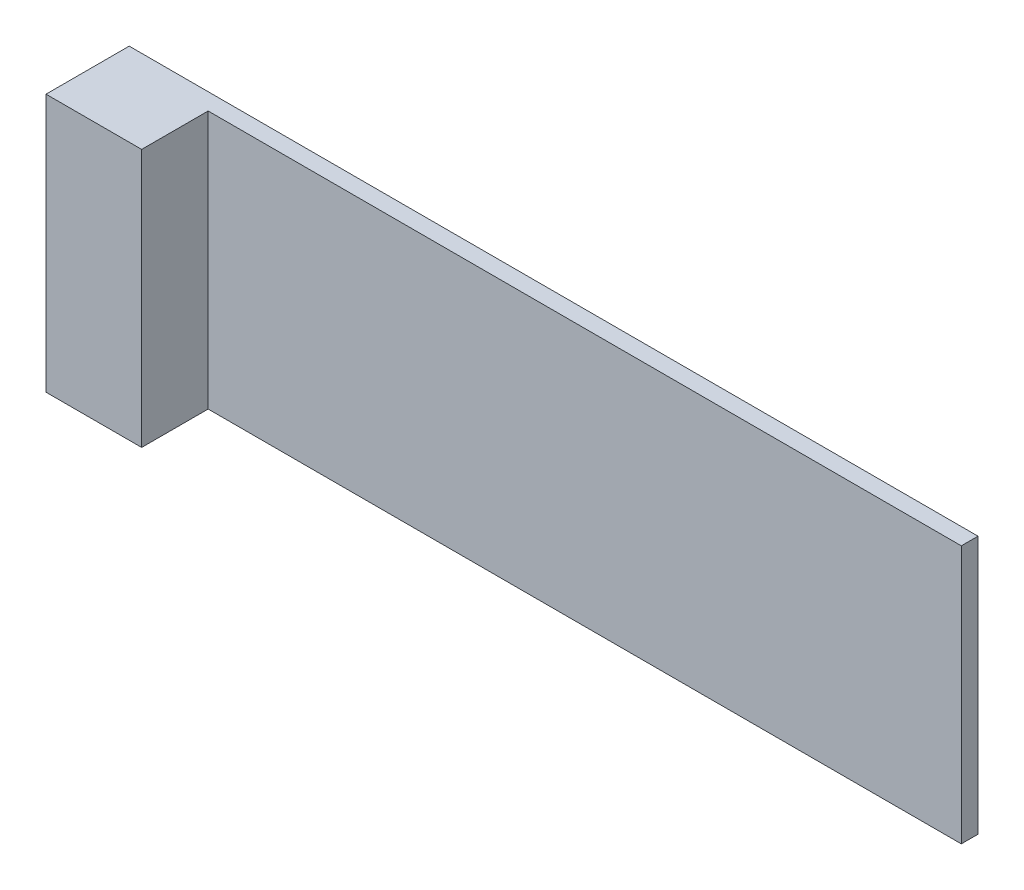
ISO-10303-21;
HEADER;
FILE_DESCRIPTION(('STEP AP214'),'2;1');
FILE_NAME('part.step','',(''),(''),'','','');
FILE_SCHEMA(('AUTOMOTIVE_DESIGN { 1 0 10303 214 1 1 1 1 }'));
ENDSEC;
DATA;
#1=APPLICATION_CONTEXT('core data for automotive mechanical design processes');
#2=APPLICATION_PROTOCOL_DEFINITION('international standard','automotive_design',2000,#1);
#3=PRODUCT_CONTEXT('',#1,'mechanical');
#4=PRODUCT('Part','Part','',(#3));
#5=PRODUCT_RELATED_PRODUCT_CATEGORY('part','',(#4));
#6=PRODUCT_DEFINITION_FORMATION('','',#4);
#7=PRODUCT_DEFINITION_CONTEXT('part definition',#1,'design');
#8=PRODUCT_DEFINITION('design','',#6,#7);
#9=PRODUCT_DEFINITION_SHAPE('','',#8);
#10=(LENGTH_UNIT() NAMED_UNIT(*) SI_UNIT(.MILLI.,.METRE.));
#11=(NAMED_UNIT(*) PLANE_ANGLE_UNIT() SI_UNIT($,.RADIAN.));
#12=(NAMED_UNIT(*) SI_UNIT($,.STERADIAN.) SOLID_ANGLE_UNIT());
#13=UNCERTAINTY_MEASURE_WITH_UNIT(LENGTH_MEASURE(1.E-05),#10,'distance_accuracy_value','');
#14=(GEOMETRIC_REPRESENTATION_CONTEXT(3) GLOBAL_UNCERTAINTY_ASSIGNED_CONTEXT((#13)) GLOBAL_UNIT_ASSIGNED_CONTEXT((#10,
#11,#12)) REPRESENTATION_CONTEXT('',''));
#15=CARTESIAN_POINT('',(0.,0.,0.));
#16=DIRECTION('',(0.,0.,1.));
#17=DIRECTION('',(1.,0.,0.));
#18=AXIS2_PLACEMENT_3D('',#15,#16,#17);
#19=CARTESIAN_POINT('',(-3.404,-0.394,0.051));
#20=DIRECTION('',(0.,0.,1.));
#21=DIRECTION('',(1.,0.,0.));
#22=AXIS2_PLACEMENT_3D('',#19,#20,#21);
#23=PLANE('',#22);
#24=DIRECTION('',(1.,0.,0.));
#25=VECTOR('',#24,1.);
#26=CARTESIAN_POINT('',(-1.105,0.394,0.051));
#27=LINE('',#26,#25);
#28=CARTESIAN_POINT('',(-3.404,0.394,0.051));
#29=VERTEX_POINT('',#28);
#30=CARTESIAN_POINT('',(-1.105,0.394,0.051));
#31=VERTEX_POINT('',#30);
#32=EDGE_CURVE('E83',#29,#31,#27,.T.);
#33=ORIENTED_EDGE('',*,*,#32,.F.);
#34=DIRECTION('',(0.,1.,0.));
#35=VECTOR('',#34,1.);
#36=CARTESIAN_POINT('',(-3.404,-0.394,0.051));
#37=LINE('',#36,#35);
#38=CARTESIAN_POINT('',(-3.404,-0.394,0.051));
#39=VERTEX_POINT('',#38);
#40=EDGE_CURVE('E20',#39,#29,#37,.T.);
#41=ORIENTED_EDGE('',*,*,#40,.F.);
#42=DIRECTION('',(1.,0.,0.));
#43=VECTOR('',#42,1.);
#44=CARTESIAN_POINT('',(-3.696,-0.394,0.051));
#45=LINE('',#44,#43);
#46=CARTESIAN_POINT('',(-1.105,-0.394,0.051));
#47=VERTEX_POINT('',#46);
#48=EDGE_CURVE('E100',#47,#39,#45,.F.);
#49=ORIENTED_EDGE('',*,*,#48,.F.);
#50=DIRECTION('',(0.,1.,0.));
#51=VECTOR('',#50,1.);
#52=CARTESIAN_POINT('',(-1.105,-0.394,0.051));
#53=LINE('',#52,#51);
#54=EDGE_CURVE('E95',#31,#47,#53,.F.);
#55=ORIENTED_EDGE('',*,*,#54,.F.);
#56=EDGE_LOOP('',(#33,#41,#49,#55));
#57=FACE_BOUND('',#56,.T.);
#58=ADVANCED_FACE('F17',(#57),#23,.T.);
#59=CARTESIAN_POINT('',(-3.404,-0.394,0.051));
#60=DIRECTION('',(1.,0.,0.));
#61=DIRECTION('',(0.,0.,-1.));
#62=AXIS2_PLACEMENT_3D('',#59,#60,#61);
#63=PLANE('',#62);
#64=DIRECTION('',(0.,1.,0.));
#65=VECTOR('',#64,1.);
#66=CARTESIAN_POINT('',(-3.404,-0.394,0.254));
#67=LINE('',#66,#65);
#68=CARTESIAN_POINT('',(-3.404,-0.394,0.254));
#69=VERTEX_POINT('',#68);
#70=CARTESIAN_POINT('',(-3.404,0.394,0.254));
#71=VERTEX_POINT('',#70);
#72=EDGE_CURVE('E71',#69,#71,#67,.T.);
#73=ORIENTED_EDGE('',*,*,#72,.F.);
#74=DIRECTION('',(0.,0.,-1.));
#75=VECTOR('',#74,1.);
#76=CARTESIAN_POINT('',(-3.404,-0.394,0.));
#77=LINE('',#76,#75);
#78=EDGE_CURVE('E103',#39,#69,#77,.F.);
#79=ORIENTED_EDGE('',*,*,#78,.F.);
#80=ORIENTED_EDGE('',*,*,#40,.T.);
#81=DIRECTION('',(0.,0.,1.));
#82=VECTOR('',#81,1.);
#83=CARTESIAN_POINT('',(-3.404,0.394,0.));
#84=LINE('',#83,#82);
#85=EDGE_CURVE('E80',#71,#29,#84,.F.);
#86=ORIENTED_EDGE('',*,*,#85,.F.);
#87=EDGE_LOOP('',(#73,#79,#80,#86));
#88=FACE_BOUND('',#87,.T.);
#89=ADVANCED_FACE('F81',(#88),#63,.T.);
#90=CARTESIAN_POINT('',(-3.696,-0.394,0.254));
#91=DIRECTION('',(0.,0.,1.));
#92=DIRECTION('',(1.,0.,0.));
#93=AXIS2_PLACEMENT_3D('',#90,#91,#92);
#94=PLANE('',#93);
#95=DIRECTION('',(1.,0.,0.));
#96=VECTOR('',#95,1.);
#97=CARTESIAN_POINT('',(-1.105,0.394,0.254));
#98=LINE('',#97,#96);
#99=CARTESIAN_POINT('',(-3.696,0.394,0.254));
#100=VERTEX_POINT('',#99);
#101=EDGE_CURVE('E75',#100,#71,#98,.T.);
#102=ORIENTED_EDGE('',*,*,#101,.F.);
#103=DIRECTION('',(0.,1.,0.));
#104=VECTOR('',#103,1.);
#105=CARTESIAN_POINT('',(-3.696,0.394,0.254));
#106=LINE('',#105,#104);
#107=CARTESIAN_POINT('',(-3.696,-0.394,0.254));
#108=VERTEX_POINT('',#107);
#109=EDGE_CURVE('E107',#108,#100,#106,.T.);
#110=ORIENTED_EDGE('',*,*,#109,.F.);
#111=DIRECTION('',(1.,0.,0.));
#112=VECTOR('',#111,1.);
#113=CARTESIAN_POINT('',(-3.696,-0.394,0.254));
#114=LINE('',#113,#112);
#115=EDGE_CURVE('E77',#69,#108,#114,.F.);
#116=ORIENTED_EDGE('',*,*,#115,.F.);
#117=ORIENTED_EDGE('',*,*,#72,.T.);
#118=EDGE_LOOP('',(#102,#110,#116,#117));
#119=FACE_BOUND('',#118,.T.);
#120=ADVANCED_FACE('F72',(#119),#94,.T.);
#121=CARTESIAN_POINT('',(-1.105,0.394,0.));
#122=DIRECTION('',(0.,1.,0.));
#123=DIRECTION('',(0.,0.,1.));
#124=AXIS2_PLACEMENT_3D('',#121,#122,#123);
#125=PLANE('',#124);
#126=ORIENTED_EDGE('',*,*,#32,.T.);
#127=DIRECTION('',(0.,0.,-1.));
#128=VECTOR('',#127,1.);
#129=CARTESIAN_POINT('',(-1.105,0.394,0.));
#130=LINE('',#129,#128);
#131=CARTESIAN_POINT('',(-1.105,0.394,0.));
#132=VERTEX_POINT('',#131);
#133=EDGE_CURVE('E92',#132,#31,#130,.F.);
#134=ORIENTED_EDGE('',*,*,#133,.F.);
#135=DIRECTION('',(-1.,0.,0.));
#136=VECTOR('',#135,1.);
#137=CARTESIAN_POINT('',(-3.696,0.394,0.));
#138=LINE('',#137,#136);
#139=CARTESIAN_POINT('',(-3.696,0.394,0.));
#140=VERTEX_POINT('',#139);
#141=EDGE_CURVE('E110',#140,#132,#138,.F.);
#142=ORIENTED_EDGE('',*,*,#141,.F.);
#143=DIRECTION('',(0.,0.,1.));
#144=VECTOR('',#143,1.);
#145=CARTESIAN_POINT('',(-3.696,0.394,0.));
#146=LINE('',#145,#144);
#147=EDGE_CURVE('E87',#100,#140,#146,.F.);
#148=ORIENTED_EDGE('',*,*,#147,.F.);
#149=ORIENTED_EDGE('',*,*,#101,.T.);
#150=ORIENTED_EDGE('',*,*,#85,.T.);
#151=EDGE_LOOP('',(#126,#134,#142,#148,#149,#150));
#152=FACE_BOUND('',#151,.T.);
#153=ADVANCED_FACE('F85',(#152),#125,.T.);
#154=CARTESIAN_POINT('',(-1.105,-0.394,0.));
#155=DIRECTION('',(1.,0.,0.));
#156=DIRECTION('',(0.,0.,-1.));
#157=AXIS2_PLACEMENT_3D('',#154,#155,#156);
#158=PLANE('',#157);
#159=ORIENTED_EDGE('',*,*,#54,.T.);
#160=DIRECTION('',(0.,0.,-1.));
#161=VECTOR('',#160,1.);
#162=CARTESIAN_POINT('',(-1.105,-0.394,0.));
#163=LINE('',#162,#161);
#164=CARTESIAN_POINT('',(-1.105,-0.394,0.));
#165=VERTEX_POINT('',#164);
#166=EDGE_CURVE('E97',#165,#47,#163,.F.);
#167=ORIENTED_EDGE('',*,*,#166,.F.);
#168=DIRECTION('',(0.,1.,0.));
#169=VECTOR('',#168,1.);
#170=CARTESIAN_POINT('',(-1.105,0.394,0.));
#171=LINE('',#170,#169);
#172=EDGE_CURVE('E113',#132,#165,#171,.F.);
#173=ORIENTED_EDGE('',*,*,#172,.F.);
#174=ORIENTED_EDGE('',*,*,#133,.T.);
#175=EDGE_LOOP('',(#159,#167,#173,#174));
#176=FACE_BOUND('',#175,.T.);
#177=ADVANCED_FACE('F123',(#176),#158,.T.);
#178=CARTESIAN_POINT('',(-3.696,-0.394,0.));
#179=DIRECTION('',(0.,-1.,0.));
#180=DIRECTION('',(0.,0.,-1.));
#181=AXIS2_PLACEMENT_3D('',#178,#179,#180);
#182=PLANE('',#181);
#183=ORIENTED_EDGE('',*,*,#115,.T.);
#184=DIRECTION('',(0.,0.,1.));
#185=VECTOR('',#184,1.);
#186=CARTESIAN_POINT('',(-3.696,-0.394,0.));
#187=LINE('',#186,#185);
#188=CARTESIAN_POINT('',(-3.696,-0.394,0.));
#189=VERTEX_POINT('',#188);
#190=EDGE_CURVE('E35',#189,#108,#187,.T.);
#191=ORIENTED_EDGE('',*,*,#190,.F.);
#192=DIRECTION('',(-1.,0.,0.));
#193=VECTOR('',#192,1.);
#194=CARTESIAN_POINT('',(-3.696,-0.394,0.));
#195=LINE('',#194,#193);
#196=EDGE_CURVE('E26',#165,#189,#195,.T.);
#197=ORIENTED_EDGE('',*,*,#196,.F.);
#198=ORIENTED_EDGE('',*,*,#166,.T.);
#199=ORIENTED_EDGE('',*,*,#48,.T.);
#200=ORIENTED_EDGE('',*,*,#78,.T.);
#201=EDGE_LOOP('',(#183,#191,#197,#198,#199,#200));
#202=FACE_BOUND('',#201,.T.);
#203=ADVANCED_FACE('F120',(#202),#182,.T.);
#204=CARTESIAN_POINT('',(-3.696,0.394,0.));
#205=DIRECTION('',(-1.,0.,0.));
#206=DIRECTION('',(0.,0.,1.));
#207=AXIS2_PLACEMENT_3D('',#204,#205,#206);
#208=PLANE('',#207);
#209=ORIENTED_EDGE('',*,*,#109,.T.);
#210=ORIENTED_EDGE('',*,*,#147,.T.);
#211=DIRECTION('',(0.,1.,0.));
#212=VECTOR('',#211,1.);
#213=CARTESIAN_POINT('',(-3.696,0.394,0.));
#214=LINE('',#213,#212);
#215=EDGE_CURVE('E11',#189,#140,#214,.T.);
#216=ORIENTED_EDGE('',*,*,#215,.F.);
#217=ORIENTED_EDGE('',*,*,#190,.T.);
#218=EDGE_LOOP('',(#209,#210,#216,#217));
#219=FACE_BOUND('',#218,.T.);
#220=ADVANCED_FACE('F127',(#219),#208,.T.);
#221=CARTESIAN_POINT('',(-3.696,0.394,0.));
#222=DIRECTION('',(0.,0.,-1.));
#223=DIRECTION('',(-1.,0.,0.));
#224=AXIS2_PLACEMENT_3D('',#221,#222,#223);
#225=PLANE('',#224);
#226=ORIENTED_EDGE('',*,*,#196,.T.);
#227=ORIENTED_EDGE('',*,*,#215,.T.);
#228=ORIENTED_EDGE('',*,*,#141,.T.);
#229=ORIENTED_EDGE('',*,*,#172,.T.);
#230=EDGE_LOOP('',(#226,#227,#228,#229));
#231=FACE_BOUND('',#230,.T.);
#232=ADVANCED_FACE('F118',(#231),#225,.T.);
#233=CLOSED_SHELL('',(#58,#89,#120,#153,#177,#203,#220,#232));
#234=MANIFOLD_SOLID_BREP('B1',#233);
#235=ADVANCED_BREP_SHAPE_REPRESENTATION('',(#18,#234),#14);
#236=SHAPE_DEFINITION_REPRESENTATION(#9,#235);
ENDSEC;
END-ISO-10303-21;
